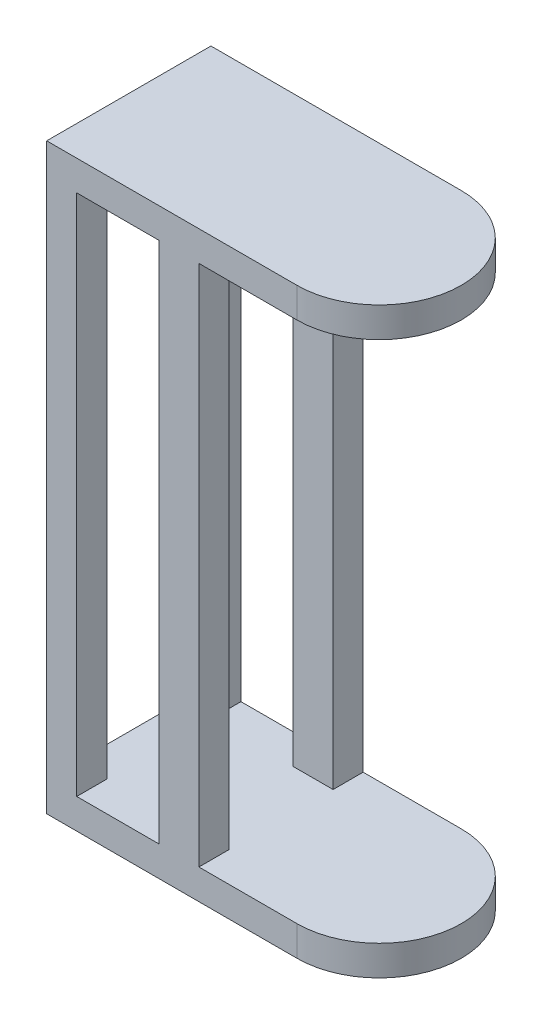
from build123d import *

# Parameters (mm, degrees)
LINEAR_AUSTRAGEN1_DEPTH         = 145.5
SKIZZE2_W                       = 90
SKIZZE2_H                       = 261
SCHNITT_LINEAR_AUSTRAGEN1_DEPTH = 210.213407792
SKIZZE3_W                       = 52
SKIZZE3_H                       = 261
SCHNITT_LINEAR_AUSTRAGEN2_DEPTH = 225.515589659
SKIZZE4_W                       = 41
SKIZZE4_H                       = 261
SCHNITT_LINEAR_AUSTRAGEN3_DEPTH = 210.213407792


with BuildPart() as part:
    # Skizze1 → Linear austragen1 (new, symmetric)
    with BuildSketch(Plane(origin=(0, 0, 0), x_dir=(1, 0, 0), z_dir=(0, 1, 0))):
        with BuildLine():
            Line((-40, 41), (85, 41))
            ThreePointArc((85, 41), (126, 0), (85, -41))
            Line((85, -41), (-40, -41))
            Line((-40, -41), (-40, 41))
        make_face()
    extrude(amount=LINEAR_AUSTRAGEN1_DEPTH, both=True)

    # Skizze2 → Schnitt-Linear austragen1 (cut, through all)
    with BuildSketch(Plane.XY.offset(41)):
        with Locations((81, 0)):
            Rectangle(SKIZZE2_W, SKIZZE2_H)
    extrude(amount=-SCHNITT_LINEAR_AUSTRAGEN1_DEPTH, mode=Mode.SUBTRACT)

    # Skizze3 → Schnitt-Linear austragen2 (cut, through all)
    with BuildSketch(Plane.ZY.offset(40)):
        Rectangle(SKIZZE3_W, SKIZZE3_H)
    extrude(amount=-SCHNITT_LINEAR_AUSTRAGEN2_DEPTH, mode=Mode.SUBTRACT)

    # Skizze4 → Schnitt-Linear austragen3 (cut, through all)
    with BuildSketch(Plane.XY.offset(41)):
        with Locations((-4.5, 0)):
            Rectangle(SKIZZE4_W, SKIZZE4_H)
    extrude(amount=-SCHNITT_LINEAR_AUSTRAGEN3_DEPTH, mode=Mode.SUBTRACT)


solid = part.part
